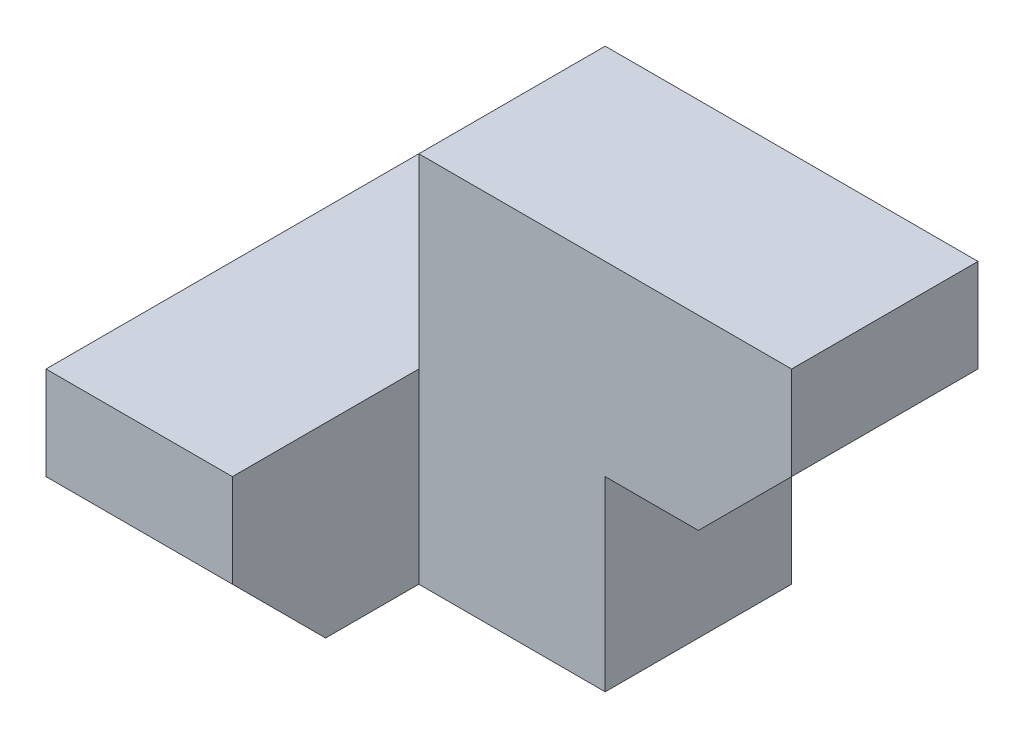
ISO-10303-21;
HEADER;
FILE_DESCRIPTION(('STEP AP214'),'2;1');
FILE_NAME('part.step','',(''),(''),'','','');
FILE_SCHEMA(('AUTOMOTIVE_DESIGN { 1 0 10303 214 1 1 1 1 }'));
ENDSEC;
DATA;
#1=APPLICATION_CONTEXT('core data for automotive mechanical design processes');
#2=APPLICATION_PROTOCOL_DEFINITION('international standard','automotive_design',2000,#1);
#3=PRODUCT_CONTEXT('',#1,'mechanical');
#4=PRODUCT('Part','Part','',(#3));
#5=PRODUCT_RELATED_PRODUCT_CATEGORY('part','',(#4));
#6=PRODUCT_DEFINITION_FORMATION('','',#4);
#7=PRODUCT_DEFINITION_CONTEXT('part definition',#1,'design');
#8=PRODUCT_DEFINITION('design','',#6,#7);
#9=PRODUCT_DEFINITION_SHAPE('','',#8);
#10=(LENGTH_UNIT() NAMED_UNIT(*) SI_UNIT(.MILLI.,.METRE.));
#11=(NAMED_UNIT(*) PLANE_ANGLE_UNIT() SI_UNIT($,.RADIAN.));
#12=(NAMED_UNIT(*) SI_UNIT($,.STERADIAN.) SOLID_ANGLE_UNIT());
#13=UNCERTAINTY_MEASURE_WITH_UNIT(LENGTH_MEASURE(1.E-05),#10,'distance_accuracy_value','');
#14=(GEOMETRIC_REPRESENTATION_CONTEXT(3) GLOBAL_UNCERTAINTY_ASSIGNED_CONTEXT((#13)) GLOBAL_UNIT_ASSIGNED_CONTEXT((#10,
#11,#12)) REPRESENTATION_CONTEXT('',''));
#15=CARTESIAN_POINT('',(0.,0.,0.));
#16=DIRECTION('',(0.,0.,1.));
#17=DIRECTION('',(1.,0.,0.));
#18=AXIS2_PLACEMENT_3D('',#15,#16,#17);
#19=CARTESIAN_POINT('',(0.,10.,10.));
#20=DIRECTION('',(1.,0.,0.));
#21=DIRECTION('',(0.,1.,0.));
#22=AXIS2_PLACEMENT_3D('',#19,#20,#21);
#23=PLANE('',#22);
#24=DIRECTION('',(0.,0.,-1.));
#25=VECTOR('',#24,1.);
#26=CARTESIAN_POINT('',(0.,0.,10.));
#27=LINE('',#26,#25);
#28=CARTESIAN_POINT('',(0.,0.,15.));
#29=VERTEX_POINT('',#28);
#30=CARTESIAN_POINT('',(0.,0.,0.));
#31=VERTEX_POINT('',#30);
#32=EDGE_CURVE('E158',#29,#31,#27,.T.);
#33=ORIENTED_EDGE('',*,*,#32,.F.);
#34=DIRECTION('',(0.,-0.707106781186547,-0.707106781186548));
#35=VECTOR('',#34,1.);
#36=CARTESIAN_POINT('',(0.,5.,20.));
#37=LINE('',#36,#35);
#38=CARTESIAN_POINT('',(0.,5.,20.));
#39=VERTEX_POINT('',#38);
#40=EDGE_CURVE('E11',#29,#39,#37,.F.);
#41=ORIENTED_EDGE('',*,*,#40,.T.);
#42=DIRECTION('',(0.,-1.,0.));
#43=VECTOR('',#42,1.);
#44=CARTESIAN_POINT('',(0.,10.,20.));
#45=LINE('',#44,#43);
#46=CARTESIAN_POINT('',(0.,10.,20.));
#47=VERTEX_POINT('',#46);
#48=EDGE_CURVE('E136',#47,#39,#45,.T.);
#49=ORIENTED_EDGE('',*,*,#48,.F.);
#50=DIRECTION('',(0.,0.,-1.));
#51=VECTOR('',#50,1.);
#52=CARTESIAN_POINT('',(0.,10.,10.));
#53=LINE('',#52,#51);
#54=CARTESIAN_POINT('',(0.,10.,0.));
#55=VERTEX_POINT('',#54);
#56=EDGE_CURVE('E135',#47,#55,#53,.T.);
#57=ORIENTED_EDGE('',*,*,#56,.T.);
#58=DIRECTION('',(0.,-1.,0.));
#59=VECTOR('',#58,1.);
#60=CARTESIAN_POINT('',(0.,10.,0.));
#61=LINE('',#60,#59);
#62=EDGE_CURVE('E140',#55,#31,#61,.T.);
#63=ORIENTED_EDGE('',*,*,#62,.T.);
#64=EDGE_LOOP('',(#33,#41,#49,#57,#63));
#65=FACE_BOUND('',#64,.T.);
#66=ADVANCED_FACE('F33',(#65),#23,.F.);
#67=CARTESIAN_POINT('',(0.,0.,10.));
#68=DIRECTION('',(0.,1.,0.));
#69=DIRECTION('',(0.,0.,1.));
#70=AXIS2_PLACEMENT_3D('',#67,#68,#69);
#71=PLANE('',#70);
#72=DIRECTION('',(0.,0.,-1.));
#73=VECTOR('',#72,1.);
#74=CARTESIAN_POINT('',(10.,0.,20.));
#75=LINE('',#74,#73);
#76=CARTESIAN_POINT('',(10.,0.,15.));
#77=VERTEX_POINT('',#76);
#78=CARTESIAN_POINT('',(10.,0.,10.));
#79=VERTEX_POINT('',#78);
#80=EDGE_CURVE('E141',#77,#79,#75,.T.);
#81=ORIENTED_EDGE('',*,*,#80,.F.);
#82=DIRECTION('',(-1.,0.,0.));
#83=VECTOR('',#82,1.);
#84=CARTESIAN_POINT('',(0.,0.,15.));
#85=LINE('',#84,#83);
#86=EDGE_CURVE('E41',#77,#29,#85,.T.);
#87=ORIENTED_EDGE('',*,*,#86,.T.);
#88=ORIENTED_EDGE('',*,*,#32,.T.);
#89=DIRECTION('',(1.,0.,0.));
#90=VECTOR('',#89,1.);
#91=CARTESIAN_POINT('',(0.,0.,0.));
#92=LINE('',#91,#90);
#93=CARTESIAN_POINT('',(20.,0.,0.));
#94=VERTEX_POINT('',#93);
#95=EDGE_CURVE('E144',#31,#94,#92,.T.);
#96=ORIENTED_EDGE('',*,*,#95,.T.);
#97=DIRECTION('',(0.,0.,-1.));
#98=VECTOR('',#97,1.);
#99=CARTESIAN_POINT('',(20.,0.,10.));
#100=LINE('',#99,#98);
#101=CARTESIAN_POINT('',(20.,0.,10.));
#102=VERTEX_POINT('',#101);
#103=EDGE_CURVE('E185',#102,#94,#100,.T.);
#104=ORIENTED_EDGE('',*,*,#103,.F.);
#105=DIRECTION('',(1.,0.,0.));
#106=VECTOR('',#105,1.);
#107=CARTESIAN_POINT('',(0.,0.,10.));
#108=LINE('',#107,#106);
#109=EDGE_CURVE('E154',#79,#102,#108,.T.);
#110=ORIENTED_EDGE('',*,*,#109,.F.);
#111=EDGE_LOOP('',(#81,#87,#88,#96,#104,#110));
#112=FACE_BOUND('',#111,.T.);
#113=ADVANCED_FACE('F243',(#112),#71,.F.);
#114=CARTESIAN_POINT('',(20.,0.,10.));
#115=DIRECTION('',(-1.,0.,0.));
#116=DIRECTION('',(0.,-1.,0.));
#117=AXIS2_PLACEMENT_3D('',#114,#115,#116);
#118=PLANE('',#117);
#119=DIRECTION('',(0.,1.,0.));
#120=VECTOR('',#119,1.);
#121=CARTESIAN_POINT('',(20.,0.,0.));
#122=LINE('',#121,#120);
#123=CARTESIAN_POINT('',(20.,10.,0.));
#124=VERTEX_POINT('',#123);
#125=EDGE_CURVE('E215',#94,#124,#122,.T.);
#126=ORIENTED_EDGE('',*,*,#125,.T.);
#127=DIRECTION('',(0.,0.,-1.));
#128=VECTOR('',#127,1.);
#129=CARTESIAN_POINT('',(20.,10.,10.));
#130=LINE('',#129,#128);
#131=CARTESIAN_POINT('',(20.,10.,10.));
#132=VERTEX_POINT('',#131);
#133=EDGE_CURVE('E188',#132,#124,#130,.T.);
#134=ORIENTED_EDGE('',*,*,#133,.F.);
#135=DIRECTION('',(0.,1.,0.));
#136=VECTOR('',#135,1.);
#137=CARTESIAN_POINT('',(20.,0.,10.));
#138=LINE('',#137,#136);
#139=EDGE_CURVE('E151',#102,#132,#138,.T.);
#140=ORIENTED_EDGE('',*,*,#139,.F.);
#141=ORIENTED_EDGE('',*,*,#103,.T.);
#142=EDGE_LOOP('',(#126,#134,#140,#141));
#143=FACE_BOUND('',#142,.T.);
#144=ADVANCED_FACE('F228',(#143),#118,.F.);
#145=CARTESIAN_POINT('',(20.,10.,10.));
#146=DIRECTION('',(0.,1.,0.));
#147=DIRECTION('',(0.,0.,1.));
#148=AXIS2_PLACEMENT_3D('',#145,#146,#147);
#149=PLANE('',#148);
#150=DIRECTION('',(1.,0.,0.));
#151=VECTOR('',#150,1.);
#152=CARTESIAN_POINT('',(20.,10.,0.));
#153=LINE('',#152,#151);
#154=CARTESIAN_POINT('',(25.,10.,0.));
#155=VERTEX_POINT('',#154);
#156=EDGE_CURVE('E213',#124,#155,#153,.T.);
#157=ORIENTED_EDGE('',*,*,#156,.T.);
#158=DIRECTION('',(0.,0.,1.));
#159=VECTOR('',#158,1.);
#160=CARTESIAN_POINT('',(25.,10.,10.));
#161=LINE('',#160,#159);
#162=CARTESIAN_POINT('',(25.,10.,10.));
#163=VERTEX_POINT('',#162);
#164=EDGE_CURVE('E171',#155,#163,#161,.T.);
#165=ORIENTED_EDGE('',*,*,#164,.T.);
#166=DIRECTION('',(1.,0.,0.));
#167=VECTOR('',#166,1.);
#168=CARTESIAN_POINT('',(20.,10.,10.));
#169=LINE('',#168,#167);
#170=EDGE_CURVE('E223',#132,#163,#169,.T.);
#171=ORIENTED_EDGE('',*,*,#170,.F.);
#172=ORIENTED_EDGE('',*,*,#133,.T.);
#173=EDGE_LOOP('',(#157,#165,#171,#172));
#174=FACE_BOUND('',#173,.T.);
#175=ADVANCED_FACE('F230',(#174),#149,.F.);
#176=CARTESIAN_POINT('',(30.,10.,10.));
#177=DIRECTION('',(-1.,0.,0.));
#178=DIRECTION('',(0.,0.,1.));
#179=AXIS2_PLACEMENT_3D('',#176,#177,#178);
#180=PLANE('',#179);
#181=DIRECTION('',(0.,1.,0.));
#182=VECTOR('',#181,1.);
#183=CARTESIAN_POINT('',(30.,10.,10.));
#184=LINE('',#183,#182);
#185=CARTESIAN_POINT('',(30.,15.,10.));
#186=VERTEX_POINT('',#185);
#187=CARTESIAN_POINT('',(30.,20.,10.));
#188=VERTEX_POINT('',#187);
#189=EDGE_CURVE('E222',#186,#188,#184,.T.);
#190=ORIENTED_EDGE('',*,*,#189,.F.);
#191=DIRECTION('',(0.,0.,-1.));
#192=VECTOR('',#191,1.);
#193=CARTESIAN_POINT('',(30.,15.,10.));
#194=LINE('',#193,#192);
#195=CARTESIAN_POINT('',(30.,15.,0.));
#196=VERTEX_POINT('',#195);
#197=EDGE_CURVE('E165',#186,#196,#194,.T.);
#198=ORIENTED_EDGE('',*,*,#197,.T.);
#199=DIRECTION('',(0.,1.,0.));
#200=VECTOR('',#199,1.);
#201=CARTESIAN_POINT('',(30.,10.,0.));
#202=LINE('',#201,#200);
#203=CARTESIAN_POINT('',(30.,20.,0.));
#204=VERTEX_POINT('',#203);
#205=EDGE_CURVE('E211',#196,#204,#202,.T.);
#206=ORIENTED_EDGE('',*,*,#205,.T.);
#207=DIRECTION('',(0.,0.,-1.));
#208=VECTOR('',#207,1.);
#209=CARTESIAN_POINT('',(30.,20.,10.));
#210=LINE('',#209,#208);
#211=EDGE_CURVE('E194',#188,#204,#210,.T.);
#212=ORIENTED_EDGE('',*,*,#211,.F.);
#213=EDGE_LOOP('',(#190,#198,#206,#212));
#214=FACE_BOUND('',#213,.T.);
#215=ADVANCED_FACE('F254',(#214),#180,.F.);
#216=CARTESIAN_POINT('',(30.,20.,10.));
#217=DIRECTION('',(0.,-1.,0.));
#218=DIRECTION('',(1.,0.,0.));
#219=AXIS2_PLACEMENT_3D('',#216,#217,#218);
#220=PLANE('',#219);
#221=DIRECTION('',(-1.,0.,0.));
#222=VECTOR('',#221,1.);
#223=CARTESIAN_POINT('',(30.,20.,0.));
#224=LINE('',#223,#222);
#225=CARTESIAN_POINT('',(10.,20.,0.));
#226=VERTEX_POINT('',#225);
#227=EDGE_CURVE('E209',#204,#226,#224,.T.);
#228=ORIENTED_EDGE('',*,*,#227,.T.);
#229=DIRECTION('',(0.,0.,-1.));
#230=VECTOR('',#229,1.);
#231=CARTESIAN_POINT('',(10.,20.,10.));
#232=LINE('',#231,#230);
#233=CARTESIAN_POINT('',(10.,20.,10.));
#234=VERTEX_POINT('',#233);
#235=EDGE_CURVE('E199',#234,#226,#232,.T.);
#236=ORIENTED_EDGE('',*,*,#235,.F.);
#237=DIRECTION('',(-1.,0.,0.));
#238=VECTOR('',#237,1.);
#239=CARTESIAN_POINT('',(30.,20.,10.));
#240=LINE('',#239,#238);
#241=EDGE_CURVE('E220',#188,#234,#240,.T.);
#242=ORIENTED_EDGE('',*,*,#241,.F.);
#243=ORIENTED_EDGE('',*,*,#211,.T.);
#244=EDGE_LOOP('',(#228,#236,#242,#243));
#245=FACE_BOUND('',#244,.T.);
#246=ADVANCED_FACE('F257',(#245),#220,.F.);
#247=CARTESIAN_POINT('',(10.,20.,10.));
#248=DIRECTION('',(1.,0.,0.));
#249=DIRECTION('',(0.,1.,0.));
#250=AXIS2_PLACEMENT_3D('',#247,#248,#249);
#251=PLANE('',#250);
#252=DIRECTION('',(0.,-1.,0.));
#253=VECTOR('',#252,1.);
#254=CARTESIAN_POINT('',(10.,20.,0.));
#255=LINE('',#254,#253);
#256=CARTESIAN_POINT('',(10.,10.,0.));
#257=VERTEX_POINT('',#256);
#258=EDGE_CURVE('E207',#226,#257,#255,.T.);
#259=ORIENTED_EDGE('',*,*,#258,.T.);
#260=DIRECTION('',(0.,0.,-1.));
#261=VECTOR('',#260,1.);
#262=CARTESIAN_POINT('',(10.,10.,10.));
#263=LINE('',#262,#261);
#264=CARTESIAN_POINT('',(10.,10.,10.));
#265=VERTEX_POINT('',#264);
#266=EDGE_CURVE('E202',#265,#257,#263,.T.);
#267=ORIENTED_EDGE('',*,*,#266,.F.);
#268=DIRECTION('',(0.,-1.,0.));
#269=VECTOR('',#268,1.);
#270=CARTESIAN_POINT('',(10.,20.,10.));
#271=LINE('',#270,#269);
#272=EDGE_CURVE('E205',#234,#265,#271,.T.);
#273=ORIENTED_EDGE('',*,*,#272,.F.);
#274=ORIENTED_EDGE('',*,*,#235,.T.);
#275=EDGE_LOOP('',(#259,#267,#273,#274));
#276=FACE_BOUND('',#275,.T.);
#277=ADVANCED_FACE('F260',(#276),#251,.F.);
#278=CARTESIAN_POINT('',(10.,10.,10.));
#279=DIRECTION('',(0.,-1.,0.));
#280=DIRECTION('',(1.,0.,0.));
#281=AXIS2_PLACEMENT_3D('',#278,#279,#280);
#282=PLANE('',#281);
#283=DIRECTION('',(-1.,0.,0.));
#284=VECTOR('',#283,1.);
#285=CARTESIAN_POINT('',(10.,10.,0.));
#286=LINE('',#285,#284);
#287=EDGE_CURVE('E157',#257,#55,#286,.T.);
#288=ORIENTED_EDGE('',*,*,#287,.T.);
#289=ORIENTED_EDGE('',*,*,#56,.F.);
#290=DIRECTION('',(-1.,0.,0.));
#291=VECTOR('',#290,1.);
#292=CARTESIAN_POINT('',(10.,10.,20.));
#293=LINE('',#292,#291);
#294=CARTESIAN_POINT('',(10.,10.,20.));
#295=VERTEX_POINT('',#294);
#296=EDGE_CURVE('E121',#295,#47,#293,.T.);
#297=ORIENTED_EDGE('',*,*,#296,.F.);
#298=DIRECTION('',(0.,0.,-1.));
#299=VECTOR('',#298,1.);
#300=CARTESIAN_POINT('',(10.,10.,20.));
#301=LINE('',#300,#299);
#302=EDGE_CURVE('E132',#295,#265,#301,.T.);
#303=ORIENTED_EDGE('',*,*,#302,.T.);
#304=ORIENTED_EDGE('',*,*,#266,.T.);
#305=EDGE_LOOP('',(#288,#289,#297,#303,#304));
#306=FACE_BOUND('',#305,.T.);
#307=ADVANCED_FACE('F130',(#306),#282,.F.);
#308=CARTESIAN_POINT('',(0.,0.,10.));
#309=DIRECTION('',(0.,0.,1.));
#310=DIRECTION('',(1.,0.,0.));
#311=AXIS2_PLACEMENT_3D('',#308,#309,#310);
#312=PLANE('',#311);
#313=ORIENTED_EDGE('',*,*,#170,.T.);
#314=DIRECTION('',(-0.707106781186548,-0.707106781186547,0.));
#315=VECTOR('',#314,1.);
#316=CARTESIAN_POINT('',(7.49999999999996,-7.49999999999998,10.));
#317=LINE('',#316,#315);
#318=EDGE_CURVE('E170',#163,#186,#317,.F.);
#319=ORIENTED_EDGE('',*,*,#318,.T.);
#320=ORIENTED_EDGE('',*,*,#189,.T.);
#321=ORIENTED_EDGE('',*,*,#241,.T.);
#322=ORIENTED_EDGE('',*,*,#272,.T.);
#323=DIRECTION('',(0.,1.,0.));
#324=VECTOR('',#323,1.);
#325=CARTESIAN_POINT('',(10.,10.,10.));
#326=LINE('',#325,#324);
#327=EDGE_CURVE('E126',#79,#265,#326,.T.);
#328=ORIENTED_EDGE('',*,*,#327,.F.);
#329=ORIENTED_EDGE('',*,*,#109,.T.);
#330=ORIENTED_EDGE('',*,*,#139,.T.);
#331=EDGE_LOOP('',(#313,#319,#320,#321,#322,#328,#329,#330));
#332=FACE_BOUND('',#331,.T.);
#333=ADVANCED_FACE('F226',(#332),#312,.T.);
#334=CARTESIAN_POINT('',(0.,0.,0.));
#335=DIRECTION('',(0.,0.,1.));
#336=DIRECTION('',(1.,0.,0.));
#337=AXIS2_PLACEMENT_3D('',#334,#335,#336);
#338=PLANE('',#337);
#339=ORIENTED_EDGE('',*,*,#205,.F.);
#340=DIRECTION('',(0.707106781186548,0.707106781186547,0.));
#341=VECTOR('',#340,1.);
#342=CARTESIAN_POINT('',(30.,15.,0.));
#343=LINE('',#342,#341);
#344=EDGE_CURVE('E176',#196,#155,#343,.F.);
#345=ORIENTED_EDGE('',*,*,#344,.T.);
#346=ORIENTED_EDGE('',*,*,#156,.F.);
#347=ORIENTED_EDGE('',*,*,#125,.F.);
#348=ORIENTED_EDGE('',*,*,#95,.F.);
#349=ORIENTED_EDGE('',*,*,#62,.F.);
#350=ORIENTED_EDGE('',*,*,#287,.F.);
#351=ORIENTED_EDGE('',*,*,#258,.F.);
#352=ORIENTED_EDGE('',*,*,#227,.F.);
#353=EDGE_LOOP('',(#339,#345,#346,#347,#348,#349,#350,#351,#352));
#354=FACE_BOUND('',#353,.T.);
#355=ADVANCED_FACE('F267',(#354),#338,.F.);
#356=CARTESIAN_POINT('',(10.,10.,20.));
#357=DIRECTION('',(-1.,0.,0.));
#358=DIRECTION('',(0.,0.,1.));
#359=AXIS2_PLACEMENT_3D('',#356,#357,#358);
#360=PLANE('',#359);
#361=DIRECTION('',(0.,1.,0.));
#362=VECTOR('',#361,1.);
#363=CARTESIAN_POINT('',(10.,10.,20.));
#364=LINE('',#363,#362);
#365=CARTESIAN_POINT('',(10.,5.,20.));
#366=VERTEX_POINT('',#365);
#367=EDGE_CURVE('E117',#366,#295,#364,.T.);
#368=ORIENTED_EDGE('',*,*,#367,.F.);
#369=DIRECTION('',(0.,0.707106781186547,0.707106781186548));
#370=VECTOR('',#369,1.);
#371=CARTESIAN_POINT('',(10.,5.,20.));
#372=LINE('',#371,#370);
#373=EDGE_CURVE('E55',#366,#77,#372,.F.);
#374=ORIENTED_EDGE('',*,*,#373,.T.);
#375=ORIENTED_EDGE('',*,*,#80,.T.);
#376=ORIENTED_EDGE('',*,*,#327,.T.);
#377=ORIENTED_EDGE('',*,*,#302,.F.);
#378=EDGE_LOOP('',(#368,#374,#375,#376,#377));
#379=FACE_BOUND('',#378,.T.);
#380=ADVANCED_FACE('F138',(#379),#360,.F.);
#381=CARTESIAN_POINT('',(0.,0.,20.));
#382=DIRECTION('',(0.,0.,-1.));
#383=DIRECTION('',(-1.,0.,0.));
#384=AXIS2_PLACEMENT_3D('',#381,#382,#383);
#385=PLANE('',#384);
#386=ORIENTED_EDGE('',*,*,#48,.T.);
#387=DIRECTION('',(1.,0.,0.));
#388=VECTOR('',#387,1.);
#389=CARTESIAN_POINT('',(0.,5.,20.));
#390=LINE('',#389,#388);
#391=EDGE_CURVE('E124',#39,#366,#390,.T.);
#392=ORIENTED_EDGE('',*,*,#391,.T.);
#393=ORIENTED_EDGE('',*,*,#367,.T.);
#394=ORIENTED_EDGE('',*,*,#296,.T.);
#395=EDGE_LOOP('',(#386,#392,#393,#394));
#396=FACE_BOUND('',#395,.T.);
#397=ADVANCED_FACE('F120',(#396),#385,.F.);
#398=CARTESIAN_POINT('',(30.,15.,10.));
#399=DIRECTION('',(-0.707106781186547,0.707106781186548,0.));
#400=DIRECTION('',(0.,0.,-1.));
#401=AXIS2_PLACEMENT_3D('',#398,#399,#400);
#402=PLANE('',#401);
#403=ORIENTED_EDGE('',*,*,#318,.F.);
#404=ORIENTED_EDGE('',*,*,#164,.F.);
#405=ORIENTED_EDGE('',*,*,#344,.F.);
#406=ORIENTED_EDGE('',*,*,#197,.F.);
#407=EDGE_LOOP('',(#403,#404,#405,#406));
#408=FACE_BOUND('',#407,.T.);
#409=ADVANCED_FACE('F233',(#408),#402,.F.);
#410=CARTESIAN_POINT('',(0.,5.,20.));
#411=DIRECTION('',(0.,0.707106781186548,-0.707106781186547));
#412=DIRECTION('',(1.,0.,0.));
#413=AXIS2_PLACEMENT_3D('',#410,#411,#412);
#414=PLANE('',#413);
#415=ORIENTED_EDGE('',*,*,#40,.F.);
#416=ORIENTED_EDGE('',*,*,#86,.F.);
#417=ORIENTED_EDGE('',*,*,#373,.F.);
#418=ORIENTED_EDGE('',*,*,#391,.F.);
#419=EDGE_LOOP('',(#415,#416,#417,#418));
#420=FACE_BOUND('',#419,.T.);
#421=ADVANCED_FACE('F35',(#420),#414,.F.);
#422=CLOSED_SHELL('',(#66,#113,#144,#175,#215,#246,#277,#307,#333,#355,#380,#397,#409,#421));
#423=MANIFOLD_SOLID_BREP('B2',#422);
#424=ADVANCED_BREP_SHAPE_REPRESENTATION('',(#18,#423),#14);
#425=SHAPE_DEFINITION_REPRESENTATION(#9,#424);
ENDSEC;
END-ISO-10303-21;
